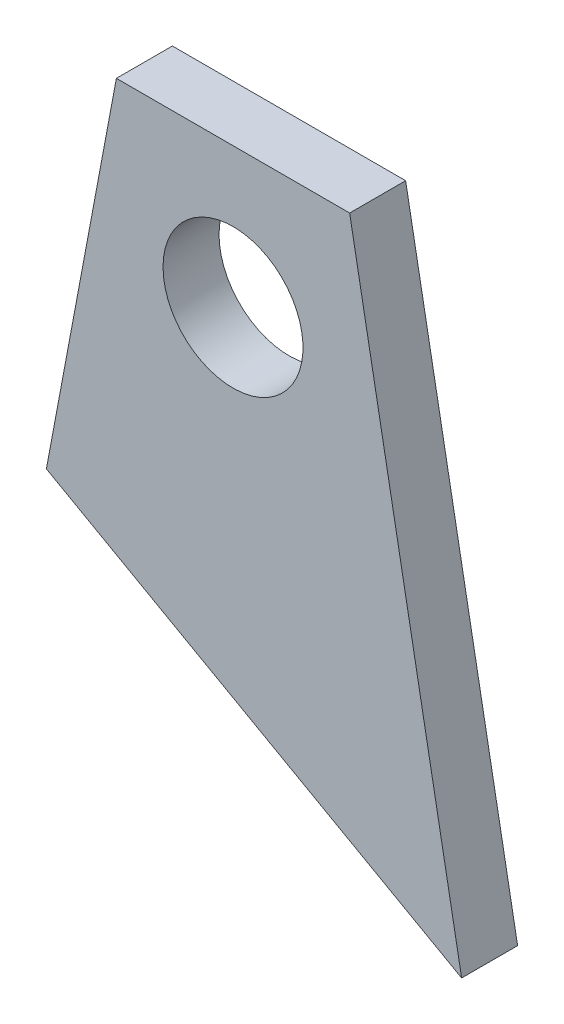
from build123d import *

# Parameters (mm, degrees)
SKETCH_1_R      = 15
EXTRUDE_1_DEPTH = 12


with BuildPart() as part:
    # Sketch 1 → Extrude 1 (new body)
    with BuildSketch(Plane.XY):
        Polygon((-25, 0), (25, 0), (49, -130), (-40, -80), align=None)
        with Locations((0, -30)):
            Circle(SKETCH_1_R, mode=Mode.SUBTRACT)
    extrude(amount=EXTRUDE_1_DEPTH)


solid = part.part
